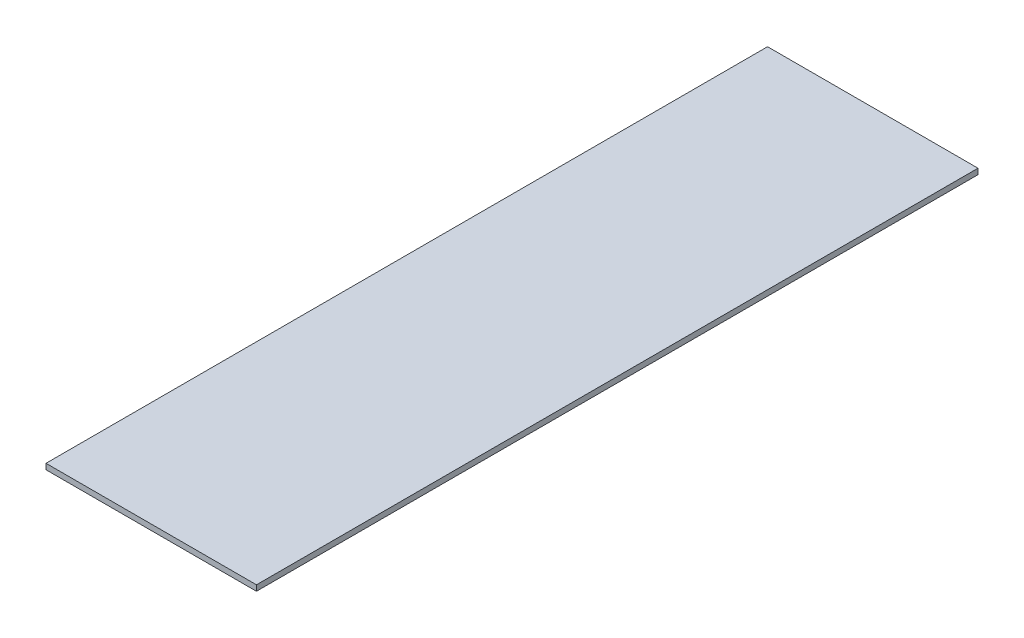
from build123d import *

# Parameters (mm, degrees)
SKETCH1_W           = 355.6
SKETCH1_H           = 1219.2
BOSS_EXTRUDE1_DEPTH = 4.7625


with BuildPart() as part:
    # Sketch1 → Boss-Extrude1 (new, symmetric)
    with BuildSketch(Plane(origin=(0, 0, 0), x_dir=(1, 0, 0), z_dir=(0, 1, 0))):
        Rectangle(SKETCH1_W, SKETCH1_H)
    extrude(amount=BOSS_EXTRUDE1_DEPTH, both=True)


solid = part.part
